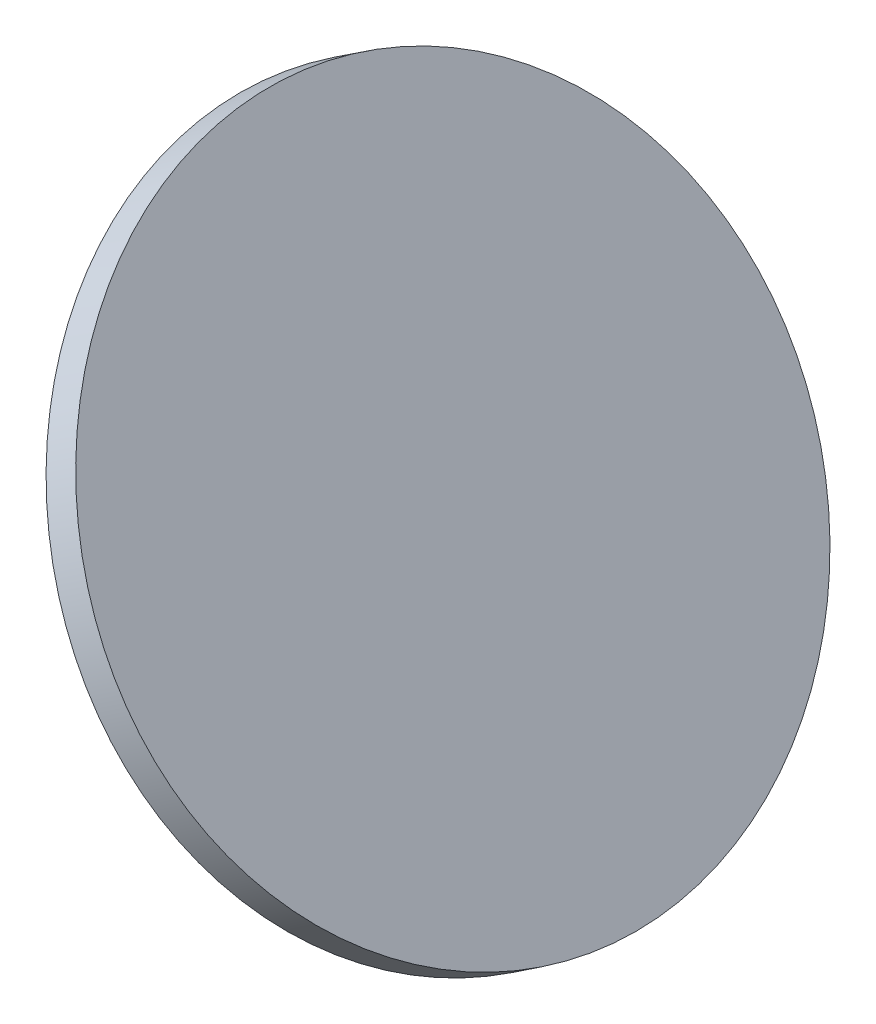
ISO-10303-21;
HEADER;
FILE_DESCRIPTION(('STEP AP214'),'2;1');
FILE_NAME('part.step','',(''),(''),'','','');
FILE_SCHEMA(('AUTOMOTIVE_DESIGN { 1 0 10303 214 1 1 1 1 }'));
ENDSEC;
DATA;
#1=APPLICATION_CONTEXT('core data for automotive mechanical design processes');
#2=APPLICATION_PROTOCOL_DEFINITION('international standard','automotive_design',2000,#1);
#3=PRODUCT_CONTEXT('',#1,'mechanical');
#4=PRODUCT('Part','Part','',(#3));
#5=PRODUCT_RELATED_PRODUCT_CATEGORY('part','',(#4));
#6=PRODUCT_DEFINITION_FORMATION('','',#4);
#7=PRODUCT_DEFINITION_CONTEXT('part definition',#1,'design');
#8=PRODUCT_DEFINITION('design','',#6,#7);
#9=PRODUCT_DEFINITION_SHAPE('','',#8);
#10=(LENGTH_UNIT() NAMED_UNIT(*) SI_UNIT(.MILLI.,.METRE.));
#11=(NAMED_UNIT(*) PLANE_ANGLE_UNIT() SI_UNIT($,.RADIAN.));
#12=(NAMED_UNIT(*) SI_UNIT($,.STERADIAN.) SOLID_ANGLE_UNIT());
#13=UNCERTAINTY_MEASURE_WITH_UNIT(LENGTH_MEASURE(1.E-05),#10,'distance_accuracy_value','');
#14=(GEOMETRIC_REPRESENTATION_CONTEXT(3) GLOBAL_UNCERTAINTY_ASSIGNED_CONTEXT((#13)) GLOBAL_UNIT_ASSIGNED_CONTEXT((#10,
#11,#12)) REPRESENTATION_CONTEXT('',''));
#15=CARTESIAN_POINT('',(0.,0.,0.));
#16=DIRECTION('',(0.,0.,1.));
#17=DIRECTION('',(1.,0.,0.));
#18=AXIS2_PLACEMENT_3D('',#15,#16,#17);
#19=CARTESIAN_POINT('',(-129.844683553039,201.886098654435,-187.750003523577));
#20=DIRECTION('',(-0.831469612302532,-0.555570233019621,9.69652979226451E-09));
#21=DIRECTION('',(0.,1.74532925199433E-08,1.));
#22=AXIS2_PLACEMENT_3D('',#19,#20,#21);
#23=SPHERICAL_SURFACE('',#22,69.7);
#24=CARTESIAN_POINT('',(-130.237531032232,202.474036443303,-188.457110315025));
#25=DIRECTION('',(-0.392847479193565,0.587937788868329,-0.707106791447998));
#26=DIRECTION('',(0.831469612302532,0.555570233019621,-9.69652981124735E-09));
#27=AXIS2_PLACEMENT_3D('',#24,#25,#26);
#28=CIRCLE('',#27,69.6928260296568);
#29=CARTESIAN_POINT('',(-184.902119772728,159.570100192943,-193.760410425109));
#30=VERTEX_POINT('',#29);
#31=CARTESIAN_POINT('',(-190.794831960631,168.389167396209,-183.153808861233));
#32=VERTEX_POINT('',#31);
#33=EDGE_CURVE('E11',#30,#32,#28,.T.);
#34=ORIENTED_EDGE('',*,*,#33,.T.);
#35=CARTESIAN_POINT('',(-190.486701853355,167.796375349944,-183.445775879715));
#36=CARTESIAN_POINT('',(-190.459346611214,167.74740960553,-183.448181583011));
#37=CARTESIAN_POINT('',(-190.431559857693,167.698408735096,-183.445886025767));
#38=CARTESIAN_POINT('',(-190.375920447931,167.601749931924,-183.431906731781));
#39=CARTESIAN_POINT('',(-190.348067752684,167.554093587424,-183.420212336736));
#40=CARTESIAN_POINT('',(-190.293115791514,167.461531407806,-183.387737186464));
#41=CARTESIAN_POINT('',(-190.266016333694,167.416624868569,-183.366958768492));
#42=CARTESIAN_POINT('',(-190.213349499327,167.330854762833,-183.316895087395));
#43=CARTESIAN_POINT('',(-190.18778174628,167.289990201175,-183.287611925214));
#44=CARTESIAN_POINT('',(-190.138986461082,167.213593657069,-183.221474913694));
#45=CARTESIAN_POINT('',(-190.115751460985,167.178044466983,-183.18464645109));
#46=CARTESIAN_POINT('',(-190.072188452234,167.113132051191,-183.104405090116));
#47=CARTESIAN_POINT('',(-190.051860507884,167.083768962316,-183.060992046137));
#48=CARTESIAN_POINT('',(-190.014724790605,167.032111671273,-182.968910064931));
#49=CARTESIAN_POINT('',(-189.997910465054,167.009804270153,-182.920251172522));
#50=CARTESIAN_POINT('',(-189.968224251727,166.972803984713,-182.818996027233));
#51=CARTESIAN_POINT('',(-189.955352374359,166.958111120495,-182.766399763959));
#52=CARTESIAN_POINT('',(-189.933884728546,166.936717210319,-182.658660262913));
#53=CARTESIAN_POINT('',(-189.92529702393,166.930031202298,-182.603512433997));
#54=CARTESIAN_POINT('',(-189.912663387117,166.924867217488,-182.492320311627));
#55=CARTESIAN_POINT('',(-189.908617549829,166.926389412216,-182.436275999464));
#56=CARTESIAN_POINT('',(-189.905159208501,166.937602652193,-182.324594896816));
#57=CARTESIAN_POINT('',(-189.905768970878,166.947332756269,-182.268961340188));
#58=CARTESIAN_POINT('',(-189.911644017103,166.974716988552,-182.159935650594));
#59=CARTESIAN_POINT('',(-189.916909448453,166.992371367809,-182.1065435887));
#60=CARTESIAN_POINT('',(-189.931980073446,167.035213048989,-182.003198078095));
#61=CARTESIAN_POINT('',(-189.941810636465,167.060442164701,-181.953265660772));
#62=CARTESIAN_POINT('',(-189.965735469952,167.117674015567,-181.858571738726));
#63=CARTESIAN_POINT('',(-189.979829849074,167.149676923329,-181.813810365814));
#64=CARTESIAN_POINT('',(-190.011947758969,167.219693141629,-181.730545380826));
#65=CARTESIAN_POINT('',(-190.02998689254,167.257730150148,-181.692067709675));
#66=CARTESIAN_POINT('',(-190.069450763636,167.338644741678,-181.622681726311));
#67=CARTESIAN_POINT('',(-190.090875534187,167.381522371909,-181.591773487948));
#68=CARTESIAN_POINT('',(-190.136521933,167.470936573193,-181.538395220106));
#69=CARTESIAN_POINT('',(-190.160745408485,167.517475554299,-181.515930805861));
#70=CARTESIAN_POINT('',(-190.211292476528,167.61286682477,-181.480127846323));
#71=CARTESIAN_POINT('',(-190.237616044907,167.661719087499,-181.466789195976));
#72=CARTESIAN_POINT('',(-190.291532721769,167.760192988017,-181.449669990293));
#73=CARTESIAN_POINT('',(-190.31912175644,167.809811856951,-181.445860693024));
#74=CARTESIAN_POINT('',(-190.37485606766,167.908542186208,-181.447854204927));
#75=CARTESIAN_POINT('',(-190.403001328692,167.957653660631,-181.453656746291));
#76=CARTESIAN_POINT('',(-190.458887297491,168.053691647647,-181.474677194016));
#77=CARTESIAN_POINT('',(-190.486629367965,168.100628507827,-181.489844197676));
#78=CARTESIAN_POINT('',(-190.541066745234,168.191246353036,-181.529137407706));
#79=CARTESIAN_POINT('',(-190.567762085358,168.234927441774,-181.553263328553));
#80=CARTESIAN_POINT('',(-190.619196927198,168.31754708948,-181.609643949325));
#81=CARTESIAN_POINT('',(-190.643946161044,168.356509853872,-181.64185430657));
#82=CARTESIAN_POINT('',(-190.690938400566,168.428846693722,-181.713555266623));
#83=CARTESIAN_POINT('',(-190.713181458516,168.462220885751,-181.753045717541));
#84=CARTESIAN_POINT('',(-190.754464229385,168.522337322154,-181.838051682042));
#85=CARTESIAN_POINT('',(-190.773513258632,168.549098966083,-181.883548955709));
#86=CARTESIAN_POINT('',(-190.807950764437,168.595366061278,-181.979362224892));
#87=CARTESIAN_POINT('',(-190.823339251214,168.614871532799,-182.029678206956));
#88=CARTESIAN_POINT('',(-190.850036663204,168.646099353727,-182.13373522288));
#89=CARTESIAN_POINT('',(-190.861342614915,168.657816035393,-182.187478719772));
#90=CARTESIAN_POINT('',(-190.879550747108,168.673133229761,-182.296835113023));
#91=CARTESIAN_POINT('',(-190.886452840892,168.676733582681,-182.352448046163));
#92=CARTESIAN_POINT('',(-190.895690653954,168.675738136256,-182.464207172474));
#93=CARTESIAN_POINT('',(-190.898007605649,168.671108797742,-182.520354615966));
#94=CARTESIAN_POINT('',(-190.897966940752,168.653743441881,-182.631379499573));
#95=CARTESIAN_POINT('',(-190.895609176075,168.64100716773,-182.686256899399));
#96=CARTESIAN_POINT('',(-190.886270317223,168.607710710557,-182.793515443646));
#97=CARTESIAN_POINT('',(-190.879263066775,168.587106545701,-182.845880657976));
#98=CARTESIAN_POINT('',(-190.860806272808,168.538677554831,-182.946310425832));
#99=CARTESIAN_POINT('',(-190.84935677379,168.510852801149,-182.994375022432));
#100=CARTESIAN_POINT('',(-190.822279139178,168.448627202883,-183.085074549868));
#101=CARTESIAN_POINT('',(-190.806631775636,168.414196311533,-183.127683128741));
#102=CARTESIAN_POINT('',(-190.771621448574,168.339807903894,-183.20601411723));
#103=CARTESIAN_POINT('',(-190.752257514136,168.299848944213,-183.241734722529));
#104=CARTESIAN_POINT('',(-190.710318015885,168.215448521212,-183.305332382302));
#105=CARTESIAN_POINT('',(-190.687735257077,168.170997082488,-183.333191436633));
#106=CARTESIAN_POINT('',(-190.640045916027,168.078979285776,-183.380126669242));
#107=CARTESIAN_POINT('',(-190.614942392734,168.031416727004,-183.399213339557));
#108=CARTESIAN_POINT('',(-190.572500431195,167.952360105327,-183.422771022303));
#109=CARTESIAN_POINT('',(-190.555697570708,167.921382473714,-183.430035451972));
#110=CARTESIAN_POINT('',(-190.521556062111,167.859066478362,-183.440767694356));
#111=CARTESIAN_POINT('',(-190.504217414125,167.827728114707,-183.444235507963));
#112=CARTESIAN_POINT('',(-190.486701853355,167.796375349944,-183.445775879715));
#113=B_SPLINE_CURVE_WITH_KNOTS('',3,(#35,#36,#37,#38,#39,#40,#41,#42,#43,#44,#45,#46,#47,#48,
#49,#50,#51,#52,#53,#54,#55,#56,#57,#58,#59,#60,#61,#62,#63,#64,#65,#66,#67,#68,#69,#70,#71,#72,
#73,#74,#75,#76,#77,#78,#79,#80,#81,#82,#83,#84,#85,#86,#87,#88,#89,#90,#91,#92,#93,#94,#95,#96,
#97,#98,#99,#100,#101,#102,#103,#104,#105,#106,#107,#108,#109,#110,#111,#112),.UNSPECIFIED.,.T.,
.F.,(4,2,2,2,2,2,2,2,2,2,2,2,2,2,2,2,2,2,2,2,2,2,2,2,2,2,2,2,2,2,2,2,2,2,2,2,2,2,4),(0.,
0.168290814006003,0.336772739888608,0.505211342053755,0.673608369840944,0.84144785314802,
1.00929104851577,1.17681837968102,1.34434615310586,1.5121880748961,1.68003350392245,
1.84868219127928,2.01733622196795,2.18693892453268,2.35654594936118,2.52683636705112,
2.69712844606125,2.86753357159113,3.037936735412,3.20782531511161,3.37770916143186,
3.546677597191,3.71564064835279,3.88369646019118,4.05174876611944,4.21930203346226,
4.38685483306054,4.55452942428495,4.72220731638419,4.89057012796,5.05893827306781,
5.22826171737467,5.39758346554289,5.56769442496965,5.7378498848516,5.90839183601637,
6.07872927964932,6.18648590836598,6.29424251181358),.UNSPECIFIED.);
#114=CARTESIAN_POINT('',(-190.009137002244,167.213291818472,-181.739595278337));
#115=VERTEX_POINT('',#114);
#116=EDGE_CURVE('E32',#32,#115,#113,.F.);
#117=ORIENTED_EDGE('',*,*,#116,.T.);
#118=CARTESIAN_POINT('',(-129.451836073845,201.298160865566,-187.042896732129));
#119=DIRECTION('',(0.392847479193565,-0.587937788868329,0.707106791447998));
#120=DIRECTION('',(-0.831469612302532,-0.555570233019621,9.69652981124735E-09));
#121=AXIS2_PLACEMENT_3D('',#118,#119,#120);
#122=CIRCLE('',#121,69.6928260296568);
#123=CARTESIAN_POINT('',(-184.116424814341,158.394224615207,-192.346196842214));
#124=VERTEX_POINT('',#123);
#125=EDGE_CURVE('E86',#115,#124,#122,.T.);
#126=ORIENTED_EDGE('',*,*,#125,.T.);
#127=CARTESIAN_POINT('',(-184.176290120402,158.668683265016,-193.948514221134));
#128=CARTESIAN_POINT('',(-184.146920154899,158.628191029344,-193.923628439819));
#129=CARTESIAN_POINT('',(-184.119081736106,158.589127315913,-193.894521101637));
#130=CARTESIAN_POINT('',(-184.0672870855,158.51500020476,-193.828672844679));
#131=CARTESIAN_POINT('',(-184.043335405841,158.479941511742,-193.791923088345));
#132=CARTESIAN_POINT('',(-184.000031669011,158.414870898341,-193.711861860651));
#133=CARTESIAN_POINT('',(-183.98067755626,158.384856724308,-193.668553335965));
#134=CARTESIAN_POINT('',(-183.947110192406,158.330717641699,-193.576610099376));
#135=CARTESIAN_POINT('',(-183.932895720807,158.30659133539,-193.527976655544));
#136=CARTESIAN_POINT('',(-183.909992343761,158.264887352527,-193.426748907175));
#137=CARTESIAN_POINT('',(-183.901304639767,158.247311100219,-193.374153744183));
#138=CARTESIAN_POINT('',(-183.889691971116,158.219195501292,-193.266502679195));
#139=CARTESIAN_POINT('',(-183.886767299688,158.208656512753,-193.211446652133));
#140=CARTESIAN_POINT('',(-183.886747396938,158.194869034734,-193.10023160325));
#141=CARTESIAN_POINT('',(-183.889672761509,158.191646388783,-193.044069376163));
#142=CARTESIAN_POINT('',(-183.901294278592,158.192636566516,-192.932412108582));
#143=CARTESIAN_POINT('',(-183.909990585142,158.196849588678,-192.876917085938));
#144=CARTESIAN_POINT('',(-183.932958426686,158.212616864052,-192.767841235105));
#145=CARTESIAN_POINT('',(-183.947260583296,158.224211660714,-192.714272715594));
#146=CARTESIAN_POINT('',(-183.981022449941,158.254436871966,-192.610876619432));
#147=CARTESIAN_POINT('',(-184.000482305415,158.273067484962,-192.561049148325));
#148=CARTESIAN_POINT('',(-184.044117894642,158.316943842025,-192.466282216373));
#149=CARTESIAN_POINT('',(-184.06831728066,158.342222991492,-192.421369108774));
#150=CARTESIAN_POINT('',(-184.120680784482,158.39863244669,-192.337990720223));
#151=CARTESIAN_POINT('',(-184.14884498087,158.429762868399,-192.299525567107));
#152=CARTESIAN_POINT('',(-184.208417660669,158.497080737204,-192.230045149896));
#153=CARTESIAN_POINT('',(-184.239834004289,158.533280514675,-192.199048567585));
#154=CARTESIAN_POINT('',(-184.304963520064,158.60965497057,-192.145519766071));
#155=CARTESIAN_POINT('',(-184.338676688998,158.649829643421,-192.122987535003));
#156=CARTESIAN_POINT('',(-184.407399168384,158.732962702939,-192.087070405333));
#157=CARTESIAN_POINT('',(-184.442406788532,158.77591751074,-192.073673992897));
#158=CARTESIAN_POINT('',(-184.512760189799,158.863434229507,-192.056390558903));
#159=CARTESIAN_POINT('',(-184.548105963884,158.907996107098,-192.052503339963));
#160=CARTESIAN_POINT('',(-184.617963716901,158.997249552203,-192.054373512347));
#161=CARTESIAN_POINT('',(-184.652478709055,159.041939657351,-192.060088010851));
#162=CARTESIAN_POINT('',(-184.719844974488,159.130364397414,-192.080943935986));
#163=CARTESIAN_POINT('',(-184.752696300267,159.174099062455,-192.096085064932));
#164=CARTESIAN_POINT('',(-184.815604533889,159.259106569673,-192.135269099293));
#165=CARTESIAN_POINT('',(-184.845676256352,159.300391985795,-192.159260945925));
#166=CARTESIAN_POINT('',(-184.90236861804,159.379582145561,-192.215485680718));
#167=CARTESIAN_POINT('',(-184.928989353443,159.41748698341,-192.247718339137));
#168=CARTESIAN_POINT('',(-184.977904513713,159.488667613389,-192.319349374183));
#169=CARTESIAN_POINT('',(-185.000217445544,159.521963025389,-192.358715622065));
#170=CARTESIAN_POINT('',(-185.040026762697,159.583173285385,-192.443587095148));
#171=CARTESIAN_POINT('',(-185.057523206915,159.611088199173,-192.489092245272));
#172=CARTESIAN_POINT('',(-185.087188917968,159.660719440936,-192.584884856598));
#173=CARTESIAN_POINT('',(-185.099364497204,159.682443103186,-192.635166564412));
#174=CARTESIAN_POINT('',(-185.118084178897,159.719133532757,-192.739127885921));
#175=CARTESIAN_POINT('',(-185.124628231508,159.73410024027,-192.792807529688));
#176=CARTESIAN_POINT('',(-185.1319232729,159.75690084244,-192.902183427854));
#177=CARTESIAN_POINT('',(-185.132659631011,159.764716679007,-192.957884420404));
#178=CARTESIAN_POINT('',(-185.128296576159,159.772951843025,-193.069603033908));
#179=CARTESIAN_POINT('',(-185.123197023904,159.77337099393,-193.125620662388));
#180=CARTESIAN_POINT('',(-185.107280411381,159.766805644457,-193.236689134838));
#181=CARTESIAN_POINT('',(-185.096434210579,159.759783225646,-193.291733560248));
#182=CARTESIAN_POINT('',(-185.069326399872,159.738493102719,-193.399016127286));
#183=CARTESIAN_POINT('',(-185.0530646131,159.724225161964,-193.451254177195));
#184=CARTESIAN_POINT('',(-185.015488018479,159.688760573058,-193.551744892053));
#185=CARTESIAN_POINT('',(-184.994145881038,159.667526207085,-193.599974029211));
#186=CARTESIAN_POINT('',(-184.947065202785,159.618758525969,-193.690769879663));
#187=CARTESIAN_POINT('',(-184.921326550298,159.591225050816,-193.733336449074));
#188=CARTESIAN_POINT('',(-184.866081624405,159.53052959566,-193.811748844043));
#189=CARTESIAN_POINT('',(-184.836562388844,159.497348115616,-193.847570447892));
#190=CARTESIAN_POINT('',(-184.774664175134,159.426363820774,-193.911284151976));
#191=CARTESIAN_POINT('',(-184.742285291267,159.388561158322,-193.939176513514));
#192=CARTESIAN_POINT('',(-184.675588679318,159.309407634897,-193.986224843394));
#193=CARTESIAN_POINT('',(-184.641271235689,159.268057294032,-194.005382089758));
#194=CARTESIAN_POINT('',(-184.571659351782,159.182964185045,-194.03440156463));
#195=CARTESIAN_POINT('',(-184.536364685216,159.13922086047,-194.044261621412));
#196=CARTESIAN_POINT('',(-184.465932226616,159.050744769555,-194.054356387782));
#197=CARTESIAN_POINT('',(-184.430794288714,159.006015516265,-194.054621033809));
#198=CARTESIAN_POINT('',(-184.361600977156,158.916750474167,-194.045560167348));
#199=CARTESIAN_POINT('',(-184.327544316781,158.872214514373,-194.036246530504));
#200=CARTESIAN_POINT('',(-184.273868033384,158.801030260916,-194.013550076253));
#201=CARTESIAN_POINT('',(-184.253615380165,158.773925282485,-194.002994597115));
#202=CARTESIAN_POINT('',(-184.214133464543,158.720583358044,-193.978362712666));
#203=CARTESIAN_POINT('',(-184.194904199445,158.694346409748,-193.964286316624));
#204=CARTESIAN_POINT('',(-184.176290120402,158.668683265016,-193.948514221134));
#205=B_SPLINE_CURVE_WITH_KNOTS('',3,(#127,#128,#129,#130,#131,#132,#133,#134,#135,#136,#137,
#138,#139,#140,#141,#142,#143,#144,#145,#146,#147,#148,#149,#150,#151,#152,#153,#154,#155,#156,
#157,#158,#159,#160,#161,#162,#163,#164,#165,#166,#167,#168,#169,#170,#171,#172,#173,#174,#175,
#176,#177,#178,#179,#180,#181,#182,#183,#184,#185,#186,#187,#188,#189,#190,#191,#192,#193,#194,
#195,#196,#197,#198,#199,#200,#201,#202,#203,#204),.UNSPECIFIED.,.T.,.F.,(4,2,2,2,2,2,2,2,2,2,2,
2,2,2,2,2,2,2,2,2,2,2,2,2,2,2,2,2,2,2,2,2,2,2,2,2,2,2,4),(0.,0.167482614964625,0.33515999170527,
0.502762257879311,0.670324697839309,0.837923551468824,1.00553093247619,1.1737294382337,
1.34193243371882,1.51106732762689,1.68020699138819,1.85021329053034,2.02022295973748,
2.19065357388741,2.36108394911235,2.53129913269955,2.70151078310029,2.87096408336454,
3.04041203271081,3.20889736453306,3.37737799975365,3.54511787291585,3.7128556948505,
3.88039397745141,4.04793374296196,4.21589543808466,4.38386114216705,4.55268684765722,
4.72151806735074,4.89127889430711,5.06104403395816,5.23140764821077,5.40176564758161,
5.57209871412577,5.74247155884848,5.91231281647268,6.08194374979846,6.18809106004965,
6.29423809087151),.UNSPECIFIED.);
#206=EDGE_CURVE('E21',#124,#30,#205,.F.);
#207=ORIENTED_EDGE('',*,*,#206,.T.);
#208=EDGE_LOOP('',(#34,#117,#126,#207));
#209=FACE_BOUND('',#208,.T.);
#210=CARTESIAN_POINT('',(-185.719441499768,164.551778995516,-187.750002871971));
#211=DIRECTION('',(-0.831469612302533,-0.555570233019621,9.69652979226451E-09));
#212=DIRECTION('',(0.555570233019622,-0.831469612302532,1.45118823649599E-08));
#213=AXIS2_PLACEMENT_3D('',#210,#211,#212);
#214=CIRCLE('',#213,18.5);
#215=CARTESIAN_POINT('',(-195.997490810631,179.933966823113,-187.75000314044));
#216=VERTEX_POINT('',#215);
#217=EDGE_CURVE('E81',#216,#216,#214,.T.);
#218=ORIENTED_EDGE('',*,*,#217,.T.);
#219=EDGE_LOOP('',(#218));
#220=FACE_BOUND('',#219,.T.);
#221=ADVANCED_FACE('F17',(#209,#220),#23,.T.);
#222=CARTESIAN_POINT('',(-182.074257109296,159.758757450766,-192.346196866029));
#223=DIRECTION('',(0.392847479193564,-0.587937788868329,0.707106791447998));
#224=DIRECTION('',(0.831469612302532,0.555570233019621,-9.69652981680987E-09));
#225=AXIS2_PLACEMENT_3D('',#222,#223,#224);
#226=PLANE('',#225);
#227=ORIENTED_EDGE('',*,*,#125,.F.);
#228=DIRECTION('',(0.831469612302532,0.555570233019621,-9.69652979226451E-09));
#229=VECTOR('',#228,1.);
#230=CARTESIAN_POINT('',(-187.9669692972,168.577824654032,-181.739595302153));
#231=LINE('',#230,#229);
#232=CARTESIAN_POINT('',(-187.9669692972,168.577824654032,-181.739595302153));
#233=VERTEX_POINT('',#232);
#234=EDGE_CURVE('E84',#115,#233,#231,.T.);
#235=ORIENTED_EDGE('',*,*,#234,.T.);
#236=DIRECTION('',(0.392847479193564,-0.587937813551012,-0.707106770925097));
#237=VECTOR('',#236,1.);
#238=CARTESIAN_POINT('',(-183.547435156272,161.963524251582,-189.69454647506));
#239=LINE('',#238,#237);
#240=CARTESIAN_POINT('',(-182.074257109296,159.758757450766,-192.346196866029));
#241=VERTEX_POINT('',#240);
#242=EDGE_CURVE('E91',#233,#241,#239,.T.);
#243=ORIENTED_EDGE('',*,*,#242,.T.);
#244=DIRECTION('',(0.831469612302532,0.555570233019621,-9.69652979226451E-09));
#245=VECTOR('',#244,1.);
#246=CARTESIAN_POINT('',(-182.074257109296,159.758757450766,-192.346196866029));
#247=LINE('',#246,#245);
#248=EDGE_CURVE('E89',#124,#241,#247,.T.);
#249=ORIENTED_EDGE('',*,*,#248,.F.);
#250=EDGE_LOOP('',(#227,#235,#243,#249));
#251=FACE_BOUND('',#250,.T.);
#252=ADVANCED_FACE('F111',(#251),#226,.F.);
#253=CARTESIAN_POINT('',(-182.467104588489,160.346695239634,-193.053303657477));
#254=DIRECTION('',(-0.831469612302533,-0.555570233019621,9.69652980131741E-09));
#255=DIRECTION('',(-0.392847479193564,0.587937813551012,0.707106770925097));
#256=AXIS2_PLACEMENT_3D('',#253,#254,#255);
#257=CYLINDRICAL_SURFACE('',#256,1.);
#258=ORIENTED_EDGE('',*,*,#206,.F.);
#259=ORIENTED_EDGE('',*,*,#248,.T.);
#260=CARTESIAN_POINT('',(-182.467104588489,160.346695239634,-193.053303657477));
#261=DIRECTION('',(0.831469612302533,0.555570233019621,-9.69652980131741E-09));
#262=DIRECTION('',(-0.392847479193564,0.587937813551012,0.707106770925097));
#263=AXIS2_PLACEMENT_3D('',#260,#261,#262);
#264=CIRCLE('',#263,1.);
#265=CARTESIAN_POINT('',(-182.859952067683,160.934633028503,-193.760410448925));
#266=VERTEX_POINT('',#265);
#267=EDGE_CURVE('E92',#241,#266,#264,.T.);
#268=ORIENTED_EDGE('',*,*,#267,.T.);
#269=DIRECTION('',(0.831469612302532,0.555570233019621,-9.69652979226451E-09));
#270=VECTOR('',#269,1.);
#271=CARTESIAN_POINT('',(-182.859952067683,160.934633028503,-193.760410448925));
#272=LINE('',#271,#270);
#273=EDGE_CURVE('E63',#30,#266,#272,.T.);
#274=ORIENTED_EDGE('',*,*,#273,.F.);
#275=EDGE_LOOP('',(#258,#259,#268,#274));
#276=FACE_BOUND('',#275,.T.);
#277=ADVANCED_FACE('F113',(#276),#257,.F.);
#278=CARTESIAN_POINT('',(-188.752664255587,169.753700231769,-183.153808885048));
#279=DIRECTION('',(-0.392847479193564,0.587937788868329,-0.707106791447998));
#280=DIRECTION('',(-0.831469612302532,-0.555570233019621,9.69652981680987E-09));
#281=AXIS2_PLACEMENT_3D('',#278,#279,#280);
#282=PLANE('',#281);
#283=DIRECTION('',(-0.392847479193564,0.587937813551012,0.707106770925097));
#284=VECTOR('',#283,1.);
#285=CARTESIAN_POINT('',(-187.279486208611,167.548933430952,-185.805459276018));
#286=LINE('',#285,#284);
#287=CARTESIAN_POINT('',(-188.752664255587,169.753700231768,-183.153808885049));
#288=VERTEX_POINT('',#287);
#289=EDGE_CURVE('E76',#266,#288,#286,.T.);
#290=ORIENTED_EDGE('',*,*,#289,.T.);
#291=DIRECTION('',(0.831469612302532,0.555570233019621,-9.69652979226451E-09));
#292=VECTOR('',#291,1.);
#293=CARTESIAN_POINT('',(-188.752664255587,169.753700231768,-183.153808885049));
#294=LINE('',#293,#292);
#295=EDGE_CURVE('E67',#32,#288,#294,.T.);
#296=ORIENTED_EDGE('',*,*,#295,.F.);
#297=ORIENTED_EDGE('',*,*,#33,.F.);
#298=ORIENTED_EDGE('',*,*,#273,.T.);
#299=EDGE_LOOP('',(#290,#296,#297,#298));
#300=FACE_BOUND('',#299,.T.);
#301=ADVANCED_FACE('F110',(#300),#282,.F.);
#302=CARTESIAN_POINT('',(-188.400930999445,162.760064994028,-187.750002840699));
#303=DIRECTION('',(0.831469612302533,0.555570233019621,-9.69652979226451E-09));
#304=DIRECTION('',(0.555570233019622,-0.831469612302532,1.45118823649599E-08));
#305=AXIS2_PLACEMENT_3D('',#302,#303,#304);
#306=CYLINDRICAL_SURFACE('',#305,18.5);
#307=CARTESIAN_POINT('',(-184.056502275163,165.662919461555,-187.750002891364));
#308=DIRECTION('',(0.831469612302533,0.555570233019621,-9.69652979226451E-09));
#309=DIRECTION('',(0.555570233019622,-0.831469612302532,1.45118823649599E-08));
#310=AXIS2_PLACEMENT_3D('',#307,#308,#309);
#311=CIRCLE('',#310,18.5);
#312=CARTESIAN_POINT('',(-173.7784529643,150.280731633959,-187.750002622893));
#313=VERTEX_POINT('',#312);
#314=EDGE_CURVE('E71',#313,#313,#311,.T.);
#315=ORIENTED_EDGE('',*,*,#314,.F.);
#316=EDGE_LOOP('',(#315));
#317=FACE_BOUND('',#316,.T.);
#318=ORIENTED_EDGE('',*,*,#217,.F.);
#319=EDGE_LOOP('',(#318));
#320=FACE_BOUND('',#319,.T.);
#321=ADVANCED_FACE('F72',(#317,#320),#306,.T.);
#322=CARTESIAN_POINT('',(-184.056502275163,165.662919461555,-187.750002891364));
#323=DIRECTION('',(0.831469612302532,0.555570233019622,-9.69652979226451E-09));
#324=DIRECTION('',(0.555570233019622,-0.831469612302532,1.45118823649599E-08));
#325=AXIS2_PLACEMENT_3D('',#322,#323,#324);
#326=PLANE('',#325);
#327=ORIENTED_EDGE('',*,*,#314,.T.);
#328=EDGE_LOOP('',(#327));
#329=FACE_BOUND('',#328,.T.);
#330=ADVANCED_FACE('F19',(#329),#326,.T.);
#331=CARTESIAN_POINT('',(-188.359816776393,169.1657624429,-182.4467020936));
#332=DIRECTION('',(-0.831469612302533,-0.555570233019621,9.69652980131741E-09));
#333=DIRECTION('',(-0.392847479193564,0.587937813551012,0.707106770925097));
#334=AXIS2_PLACEMENT_3D('',#331,#332,#333);
#335=CYLINDRICAL_SURFACE('',#334,1.);
#336=ORIENTED_EDGE('',*,*,#116,.F.);
#337=ORIENTED_EDGE('',*,*,#295,.T.);
#338=CARTESIAN_POINT('',(-188.359816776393,169.1657624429,-182.4467020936));
#339=DIRECTION('',(0.831469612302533,0.555570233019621,-9.69652980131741E-09));
#340=DIRECTION('',(-0.392847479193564,0.587937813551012,0.707106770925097));
#341=AXIS2_PLACEMENT_3D('',#338,#339,#340);
#342=CIRCLE('',#341,1.);
#343=EDGE_CURVE('E78',#288,#233,#342,.T.);
#344=ORIENTED_EDGE('',*,*,#343,.T.);
#345=ORIENTED_EDGE('',*,*,#234,.F.);
#346=EDGE_LOOP('',(#336,#337,#344,#345));
#347=FACE_BOUND('',#346,.T.);
#348=ADVANCED_FACE('F105',(#347),#335,.F.);
#349=CARTESIAN_POINT('',(-185.413460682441,164.756228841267,-187.750002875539));
#350=DIRECTION('',(-0.831469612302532,-0.555570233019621,9.69652979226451E-09));
#351=DIRECTION('',(0.,1.74532925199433E-08,1.));
#352=AXIS2_PLACEMENT_3D('',#349,#350,#351);
#353=PLANE('',#352);
#354=ORIENTED_EDGE('',*,*,#242,.F.);
#355=ORIENTED_EDGE('',*,*,#343,.F.);
#356=ORIENTED_EDGE('',*,*,#289,.F.);
#357=ORIENTED_EDGE('',*,*,#267,.F.);
#358=EDGE_LOOP('',(#354,#355,#356,#357));
#359=FACE_BOUND('',#358,.T.);
#360=ADVANCED_FACE('F109',(#359),#353,.T.);
#361=CLOSED_SHELL('',(#221,#252,#277,#301,#321,#330,#348,#360));
#362=MANIFOLD_SOLID_BREP('B1',#361);
#363=ADVANCED_BREP_SHAPE_REPRESENTATION('',(#18,#362),#14);
#364=SHAPE_DEFINITION_REPRESENTATION(#9,#363);
ENDSEC;
END-ISO-10303-21;
